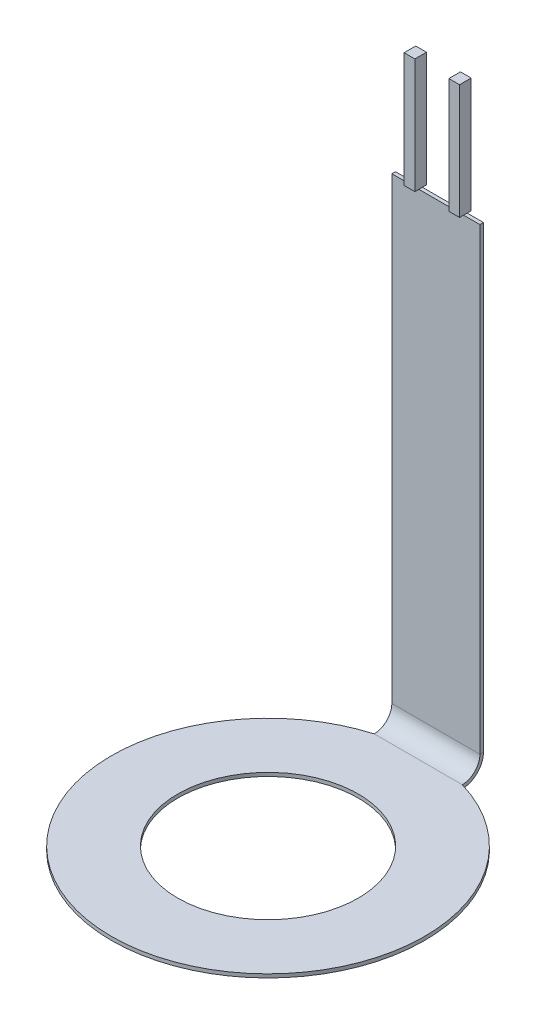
ISO-10303-21;
HEADER;
FILE_DESCRIPTION(('STEP AP214'),'2;1');
FILE_NAME('part.step','',(''),(''),'','','');
FILE_SCHEMA(('AUTOMOTIVE_DESIGN { 1 0 10303 214 1 1 1 1 }'));
ENDSEC;
DATA;
#1=APPLICATION_CONTEXT('core data for automotive mechanical design processes');
#2=APPLICATION_PROTOCOL_DEFINITION('international standard','automotive_design',2000,#1);
#3=PRODUCT_CONTEXT('',#1,'mechanical');
#4=PRODUCT('Part','Part','',(#3));
#5=PRODUCT_RELATED_PRODUCT_CATEGORY('part','',(#4));
#6=PRODUCT_DEFINITION_FORMATION('','',#4);
#7=PRODUCT_DEFINITION_CONTEXT('part definition',#1,'design');
#8=PRODUCT_DEFINITION('design','',#6,#7);
#9=PRODUCT_DEFINITION_SHAPE('','',#8);
#10=(LENGTH_UNIT() NAMED_UNIT(*) SI_UNIT(.MILLI.,.METRE.));
#11=(NAMED_UNIT(*) PLANE_ANGLE_UNIT() SI_UNIT($,.RADIAN.));
#12=(NAMED_UNIT(*) SI_UNIT($,.STERADIAN.) SOLID_ANGLE_UNIT());
#13=UNCERTAINTY_MEASURE_WITH_UNIT(LENGTH_MEASURE(1.E-05),#10,'distance_accuracy_value','');
#14=(GEOMETRIC_REPRESENTATION_CONTEXT(3) GLOBAL_UNCERTAINTY_ASSIGNED_CONTEXT((#13)) GLOBAL_UNIT_ASSIGNED_CONTEXT((#10,
#11,#12)) REPRESENTATION_CONTEXT('',''));
#15=CARTESIAN_POINT('',(0.,0.,0.));
#16=DIRECTION('',(0.,0.,1.));
#17=DIRECTION('',(1.,0.,0.));
#18=AXIS2_PLACEMENT_3D('',#15,#16,#17);
#19=CARTESIAN_POINT('',(2.5,27.0468,-9.73444258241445));
#20=DIRECTION('',(0.,-1.,0.));
#21=DIRECTION('',(0.,0.,-1.));
#22=AXIS2_PLACEMENT_3D('',#19,#20,#21);
#23=PLANE('',#22);
#24=DIRECTION('',(0.,0.,-1.));
#25=VECTOR('',#24,1.);
#26=CARTESIAN_POINT('',(1.5748,27.0468,-9.96304258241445));
#27=LINE('',#26,#25);
#28=CARTESIAN_POINT('',(1.5748,27.0468,-9.53124258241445));
#29=VERTEX_POINT('',#28);
#30=CARTESIAN_POINT('',(1.5748,27.0468,-9.73444258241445));
#31=VERTEX_POINT('',#30);
#32=EDGE_CURVE('E478',#29,#31,#27,.T.);
#33=ORIENTED_EDGE('',*,*,#32,.F.);
#34=DIRECTION('',(-1.,0.,0.));
#35=VECTOR('',#34,1.);
#36=CARTESIAN_POINT('',(2.5,27.0468,-9.53124258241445));
#37=LINE('',#36,#35);
#38=CARTESIAN_POINT('',(2.5,27.0468,-9.53124258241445));
#39=VERTEX_POINT('',#38);
#40=EDGE_CURVE('E352',#29,#39,#37,.F.);
#41=ORIENTED_EDGE('',*,*,#40,.T.);
#42=DIRECTION('',(0.,0.,1.));
#43=VECTOR('',#42,1.);
#44=CARTESIAN_POINT('',(2.5,27.0468,-9.73444258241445));
#45=LINE('',#44,#43);
#46=CARTESIAN_POINT('',(2.5,27.0468,-9.73444258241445));
#47=VERTEX_POINT('',#46);
#48=EDGE_CURVE('E328',#47,#39,#45,.T.);
#49=ORIENTED_EDGE('',*,*,#48,.F.);
#50=DIRECTION('',(1.,0.,0.));
#51=VECTOR('',#50,1.);
#52=CARTESIAN_POINT('',(0.,27.0468,-9.73444258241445));
#53=LINE('',#52,#51);
#54=EDGE_CURVE('E85',#31,#47,#53,.T.);
#55=ORIENTED_EDGE('',*,*,#54,.F.);
#56=EDGE_LOOP('',(#33,#41,#49,#55));
#57=FACE_BOUND('',#56,.T.);
#58=ADVANCED_FACE('F62',(#57),#23,.F.);
#59=DIRECTION('',(0.,0.,1.));
#60=VECTOR('',#59,1.);
#61=CARTESIAN_POINT('',(0.965199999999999,27.0468,-9.96304258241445));
#62=LINE('',#61,#60);
#63=CARTESIAN_POINT('',(0.965199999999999,27.0468,-9.73444258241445));
#64=VERTEX_POINT('',#63);
#65=CARTESIAN_POINT('',(0.965199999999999,27.0468,-9.53124258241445));
#66=VERTEX_POINT('',#65);
#67=EDGE_CURVE('E96',#64,#66,#62,.T.);
#68=ORIENTED_EDGE('',*,*,#67,.F.);
#69=CARTESIAN_POINT('',(-0.965199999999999,27.0468,-9.73444258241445));
#70=VERTEX_POINT('',#69);
#71=EDGE_CURVE('E425',#70,#64,#53,.T.);
#72=ORIENTED_EDGE('',*,*,#71,.F.);
#73=DIRECTION('',(0.,0.,-1.));
#74=VECTOR('',#73,1.);
#75=CARTESIAN_POINT('',(-0.9652,27.0468,-9.96304258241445));
#76=LINE('',#75,#74);
#77=CARTESIAN_POINT('',(-0.965199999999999,27.0468,-9.53124258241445));
#78=VERTEX_POINT('',#77);
#79=EDGE_CURVE('E13',#78,#70,#76,.T.);
#80=ORIENTED_EDGE('',*,*,#79,.F.);
#81=EDGE_CURVE('E461',#78,#66,#37,.F.);
#82=ORIENTED_EDGE('',*,*,#81,.T.);
#83=EDGE_LOOP('',(#68,#72,#80,#82));
#84=FACE_BOUND('',#83,.T.);
#85=ADVANCED_FACE('F505',(#84),#23,.F.);
#86=DIRECTION('',(0.,0.,1.));
#87=VECTOR('',#86,1.);
#88=CARTESIAN_POINT('',(-1.5748,27.0468,-9.96304258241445));
#89=LINE('',#88,#87);
#90=CARTESIAN_POINT('',(-1.5748,27.0468,-9.73444258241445));
#91=VERTEX_POINT('',#90);
#92=CARTESIAN_POINT('',(-1.5748,27.0468,-9.53124258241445));
#93=VERTEX_POINT('',#92);
#94=EDGE_CURVE('E72',#91,#93,#89,.T.);
#95=ORIENTED_EDGE('',*,*,#94,.F.);
#96=CARTESIAN_POINT('',(-2.5,27.0468,-9.73444258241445));
#97=VERTEX_POINT('',#96);
#98=EDGE_CURVE('E336',#97,#91,#53,.T.);
#99=ORIENTED_EDGE('',*,*,#98,.F.);
#100=DIRECTION('',(0.,0.,1.));
#101=VECTOR('',#100,1.);
#102=CARTESIAN_POINT('',(-2.5,27.0468,-9.73444258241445));
#103=LINE('',#102,#101);
#104=CARTESIAN_POINT('',(-2.5,27.0468,-9.53124258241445));
#105=VERTEX_POINT('',#104);
#106=EDGE_CURVE('E323',#97,#105,#103,.T.);
#107=ORIENTED_EDGE('',*,*,#106,.T.);
#108=EDGE_CURVE('E348',#105,#93,#37,.F.);
#109=ORIENTED_EDGE('',*,*,#108,.T.);
#110=EDGE_LOOP('',(#95,#99,#107,#109));
#111=FACE_BOUND('',#110,.T.);
#112=ADVANCED_FACE('F530',(#111),#23,.F.);
#113=CARTESIAN_POINT('',(0.,0.,0.));
#114=DIRECTION('',(0.,1.,0.));
#115=DIRECTION('',(0.,0.,1.));
#116=AXIS2_PLACEMENT_3D('',#113,#114,#115);
#117=PLANE('',#116);
#118=CARTESIAN_POINT('',(0.,0.,0.));
#119=DIRECTION('',(0.,1.,0.));
#120=DIRECTION('',(0.,0.,1.));
#121=AXIS2_PLACEMENT_3D('',#118,#119,#120);
#122=CIRCLE('',#121,5.125);
#123=CARTESIAN_POINT('',(0.,0.,5.125));
#124=VERTEX_POINT('',#123);
#125=EDGE_CURVE('E314',#124,#124,#122,.T.);
#126=ORIENTED_EDGE('',*,*,#125,.F.);
#127=EDGE_LOOP('',(#126));
#128=FACE_BOUND('',#127,.T.);
#129=DIRECTION('',(-1.,0.,0.));
#130=VECTOR('',#129,1.);
#131=CARTESIAN_POINT('',(-2.5,0.,-8.53124258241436));
#132=LINE('',#131,#130);
#133=CARTESIAN_POINT('',(2.5,0.,-8.53124258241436));
#134=VERTEX_POINT('',#133);
#135=CARTESIAN_POINT('',(-2.5,0.,-8.53124258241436));
#136=VERTEX_POINT('',#135);
#137=EDGE_CURVE('E392',#134,#136,#132,.T.);
#138=ORIENTED_EDGE('',*,*,#137,.T.);
#139=CARTESIAN_POINT('',(0.,0.,0.));
#140=DIRECTION('',(0.,1.,0.));
#141=DIRECTION('',(0.,0.,1.));
#142=AXIS2_PLACEMENT_3D('',#139,#140,#141);
#143=CIRCLE('',#142,8.89);
#144=EDGE_CURVE('E388',#136,#134,#143,.T.);
#145=ORIENTED_EDGE('',*,*,#144,.T.);
#146=EDGE_LOOP('',(#138,#145));
#147=FACE_BOUND('',#146,.T.);
#148=ADVANCED_FACE('F64',(#128,#147),#117,.T.);
#149=CARTESIAN_POINT('',(0.,-0.2042,0.));
#150=DIRECTION('',(0.,1.,0.));
#151=DIRECTION('',(0.,0.,1.));
#152=AXIS2_PLACEMENT_3D('',#149,#150,#151);
#153=CYLINDRICAL_SURFACE('',#152,8.89);
#154=DIRECTION('',(0.,1.,0.));
#155=VECTOR('',#154,1.);
#156=CARTESIAN_POINT('',(2.5,-0.2042,-8.53124258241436));
#157=LINE('',#156,#155);
#158=CARTESIAN_POINT('',(2.5,-0.2032,-8.53124258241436));
#159=VERTEX_POINT('',#158);
#160=EDGE_CURVE('E396',#159,#134,#157,.T.);
#161=ORIENTED_EDGE('',*,*,#160,.T.);
#162=ORIENTED_EDGE('',*,*,#144,.F.);
#163=DIRECTION('',(0.,1.,0.));
#164=VECTOR('',#163,1.);
#165=CARTESIAN_POINT('',(-2.5,-0.2042,-8.53124258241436));
#166=LINE('',#165,#164);
#167=CARTESIAN_POINT('',(-2.5,-0.203200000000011,-8.53124258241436));
#168=VERTEX_POINT('',#167);
#169=EDGE_CURVE('E397',#168,#136,#166,.T.);
#170=ORIENTED_EDGE('',*,*,#169,.F.);
#171=CARTESIAN_POINT('',(0.,-0.2032,0.));
#172=DIRECTION('',(0.,1.,0.));
#173=DIRECTION('',(0.,0.,1.));
#174=AXIS2_PLACEMENT_3D('',#171,#172,#173);
#175=CIRCLE('',#174,8.89);
#176=EDGE_CURVE('E373',#159,#168,#175,.F.);
#177=ORIENTED_EDGE('',*,*,#176,.F.);
#178=EDGE_LOOP('',(#161,#162,#170,#177));
#179=FACE_BOUND('',#178,.T.);
#180=ADVANCED_FACE('F405',(#179),#153,.T.);
#181=CARTESIAN_POINT('',(0.,-0.2032,0.));
#182=DIRECTION('',(0.,1.,0.));
#183=DIRECTION('',(0.,0.,1.));
#184=AXIS2_PLACEMENT_3D('',#181,#182,#183);
#185=PLANE('',#184);
#186=CARTESIAN_POINT('',(0.,-0.2032,0.));
#187=DIRECTION('',(0.,1.,0.));
#188=DIRECTION('',(0.,0.,1.));
#189=AXIS2_PLACEMENT_3D('',#186,#187,#188);
#190=CIRCLE('',#189,5.125);
#191=CARTESIAN_POINT('',(0.,-0.2032,5.125));
#192=VERTEX_POINT('',#191);
#193=EDGE_CURVE('E318',#192,#192,#190,.F.);
#194=ORIENTED_EDGE('',*,*,#193,.F.);
#195=EDGE_LOOP('',(#194));
#196=FACE_BOUND('',#195,.T.);
#197=ORIENTED_EDGE('',*,*,#176,.T.);
#198=DIRECTION('',(1.,0.,0.));
#199=VECTOR('',#198,1.);
#200=CARTESIAN_POINT('',(-2.5,-0.2032,-8.53124258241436));
#201=LINE('',#200,#199);
#202=EDGE_CURVE('E66',#168,#159,#201,.T.);
#203=ORIENTED_EDGE('',*,*,#202,.T.);
#204=EDGE_LOOP('',(#197,#203));
#205=FACE_BOUND('',#204,.T.);
#206=ADVANCED_FACE('F544',(#196,#205),#185,.F.);
#207=CARTESIAN_POINT('',(2.5,0.99999999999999,-8.53124258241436));
#208=DIRECTION('',(1.,0.,0.));
#209=DIRECTION('',(0.,0.,-1.));
#210=AXIS2_PLACEMENT_3D('',#207,#208,#209);
#211=PLANE('',#210);
#212=DIRECTION('',(0.,0.,1.));
#213=VECTOR('',#212,1.);
#214=CARTESIAN_POINT('',(2.5,0.999999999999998,-9.73444258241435));
#215=LINE('',#214,#213);
#216=CARTESIAN_POINT('',(2.5,0.999999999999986,-9.53124258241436));
#217=VERTEX_POINT('',#216);
#218=CARTESIAN_POINT('',(2.5,0.999999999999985,-9.73444258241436));
#219=VERTEX_POINT('',#218);
#220=EDGE_CURVE('E322',#217,#219,#215,.F.);
#221=ORIENTED_EDGE('',*,*,#220,.F.);
#222=CARTESIAN_POINT('',(2.5,0.99999999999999,-8.53124258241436));
#223=DIRECTION('',(-1.,0.,0.));
#224=DIRECTION('',(0.,0.,1.));
#225=AXIS2_PLACEMENT_3D('',#222,#223,#224);
#226=CIRCLE('',#225,1.);
#227=EDGE_CURVE('E378',#134,#217,#226,.F.);
#228=ORIENTED_EDGE('',*,*,#227,.F.);
#229=ORIENTED_EDGE('',*,*,#160,.F.);
#230=CARTESIAN_POINT('',(2.5,0.99999999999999,-8.53124258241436));
#231=DIRECTION('',(-1.,0.,0.));
#232=DIRECTION('',(0.,0.,1.));
#233=AXIS2_PLACEMENT_3D('',#230,#231,#232);
#234=CIRCLE('',#233,1.2032);
#235=EDGE_CURVE('E369',#159,#219,#234,.F.);
#236=ORIENTED_EDGE('',*,*,#235,.T.);
#237=EDGE_LOOP('',(#221,#228,#229,#236));
#238=FACE_BOUND('',#237,.T.);
#239=ADVANCED_FACE('F415',(#238),#211,.T.);
#240=CARTESIAN_POINT('',(-2.5,0.99999999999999,-8.53124258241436));
#241=DIRECTION('',(1.,0.,0.));
#242=DIRECTION('',(0.,0.,-1.));
#243=AXIS2_PLACEMENT_3D('',#240,#241,#242);
#244=PLANE('',#243);
#245=CARTESIAN_POINT('',(-2.5,0.99999999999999,-8.53124258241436));
#246=DIRECTION('',(-1.,0.,0.));
#247=DIRECTION('',(0.,0.,1.));
#248=AXIS2_PLACEMENT_3D('',#245,#246,#247);
#249=CIRCLE('',#248,1.);
#250=CARTESIAN_POINT('',(-2.5,0.999999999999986,-9.53124258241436));
#251=VERTEX_POINT('',#250);
#252=EDGE_CURVE('E327',#251,#136,#249,.T.);
#253=ORIENTED_EDGE('',*,*,#252,.F.);
#254=DIRECTION('',(0.,0.,1.));
#255=VECTOR('',#254,1.);
#256=CARTESIAN_POINT('',(-2.5,0.999999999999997,-9.53124258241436));
#257=LINE('',#256,#255);
#258=CARTESIAN_POINT('',(-2.5,0.999999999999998,-9.73444258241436));
#259=VERTEX_POINT('',#258);
#260=EDGE_CURVE('E359',#251,#259,#257,.F.);
#261=ORIENTED_EDGE('',*,*,#260,.T.);
#262=CARTESIAN_POINT('',(-2.5,0.99999999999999,-8.53124258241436));
#263=DIRECTION('',(-1.,0.,0.));
#264=DIRECTION('',(0.,0.,1.));
#265=AXIS2_PLACEMENT_3D('',#262,#263,#264);
#266=CIRCLE('',#265,1.2032);
#267=EDGE_CURVE('E374',#259,#168,#266,.T.);
#268=ORIENTED_EDGE('',*,*,#267,.T.);
#269=ORIENTED_EDGE('',*,*,#169,.T.);
#270=EDGE_LOOP('',(#253,#261,#268,#269));
#271=FACE_BOUND('',#270,.T.);
#272=ADVANCED_FACE('F432',(#271),#244,.F.);
#273=CARTESIAN_POINT('',(-2.5,0.99999999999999,-8.53124258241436));
#274=DIRECTION('',(-1.,0.,0.));
#275=DIRECTION('',(0.,0.,-1.));
#276=AXIS2_PLACEMENT_3D('',#273,#274,#275);
#277=CYLINDRICAL_SURFACE('',#276,1.2032);
#278=ORIENTED_EDGE('',*,*,#202,.F.);
#279=ORIENTED_EDGE('',*,*,#267,.F.);
#280=DIRECTION('',(-1.,0.,0.));
#281=VECTOR('',#280,1.);
#282=CARTESIAN_POINT('',(2.5,0.999999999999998,-9.73444258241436));
#283=LINE('',#282,#281);
#284=EDGE_CURVE('E356',#259,#219,#283,.F.);
#285=ORIENTED_EDGE('',*,*,#284,.T.);
#286=ORIENTED_EDGE('',*,*,#235,.F.);
#287=EDGE_LOOP('',(#278,#279,#285,#286));
#288=FACE_BOUND('',#287,.T.);
#289=ADVANCED_FACE('F558',(#288),#277,.T.);
#290=CARTESIAN_POINT('',(-2.5,0.99999999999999,-8.53124258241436));
#291=DIRECTION('',(-1.,0.,0.));
#292=DIRECTION('',(0.,0.,-1.));
#293=AXIS2_PLACEMENT_3D('',#290,#291,#292);
#294=CYLINDRICAL_SURFACE('',#293,1.);
#295=ORIENTED_EDGE('',*,*,#137,.F.);
#296=ORIENTED_EDGE('',*,*,#227,.T.);
#297=DIRECTION('',(-1.,0.,0.));
#298=VECTOR('',#297,1.);
#299=CARTESIAN_POINT('',(2.5,0.999999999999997,-9.53124258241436));
#300=LINE('',#299,#298);
#301=EDGE_CURVE('E363',#217,#251,#300,.T.);
#302=ORIENTED_EDGE('',*,*,#301,.T.);
#303=ORIENTED_EDGE('',*,*,#252,.T.);
#304=EDGE_LOOP('',(#295,#296,#302,#303));
#305=FACE_BOUND('',#304,.T.);
#306=ADVANCED_FACE('F412',(#305),#294,.F.);
#307=CARTESIAN_POINT('',(-2.5,27.0468,-9.73444258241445));
#308=DIRECTION('',(1.,0.,0.));
#309=DIRECTION('',(0.,0.,-1.));
#310=AXIS2_PLACEMENT_3D('',#307,#308,#309);
#311=PLANE('',#310);
#312=ORIENTED_EDGE('',*,*,#260,.F.);
#313=DIRECTION('',(0.,-1.,0.));
#314=VECTOR('',#313,1.);
#315=CARTESIAN_POINT('',(-2.5,27.0468,-9.53124258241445));
#316=LINE('',#315,#314);
#317=EDGE_CURVE('E353',#251,#105,#316,.F.);
#318=ORIENTED_EDGE('',*,*,#317,.T.);
#319=ORIENTED_EDGE('',*,*,#106,.F.);
#320=DIRECTION('',(0.,1.,0.));
#321=VECTOR('',#320,1.);
#322=CARTESIAN_POINT('',(-2.5,0.,-9.73444258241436));
#323=LINE('',#322,#321);
#324=EDGE_CURVE('E341',#259,#97,#323,.T.);
#325=ORIENTED_EDGE('',*,*,#324,.F.);
#326=EDGE_LOOP('',(#312,#318,#319,#325));
#327=FACE_BOUND('',#326,.T.);
#328=ADVANCED_FACE('F434',(#327),#311,.F.);
#329=CARTESIAN_POINT('',(2.5,0.,-9.73444258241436));
#330=DIRECTION('',(-1.,0.,0.));
#331=DIRECTION('',(0.,0.,1.));
#332=AXIS2_PLACEMENT_3D('',#329,#330,#331);
#333=PLANE('',#332);
#334=ORIENTED_EDGE('',*,*,#220,.T.);
#335=DIRECTION('',(0.,-1.,0.));
#336=VECTOR('',#335,1.);
#337=CARTESIAN_POINT('',(2.5,0.,-9.73444258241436));
#338=LINE('',#337,#336);
#339=EDGE_CURVE('E332',#47,#219,#338,.T.);
#340=ORIENTED_EDGE('',*,*,#339,.F.);
#341=ORIENTED_EDGE('',*,*,#48,.T.);
#342=DIRECTION('',(0.,1.,0.));
#343=VECTOR('',#342,1.);
#344=CARTESIAN_POINT('',(2.5,0.,-9.53124258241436));
#345=LINE('',#344,#343);
#346=EDGE_CURVE('E344',#39,#217,#345,.F.);
#347=ORIENTED_EDGE('',*,*,#346,.T.);
#348=EDGE_LOOP('',(#334,#340,#341,#347));
#349=FACE_BOUND('',#348,.T.);
#350=ADVANCED_FACE('F418',(#349),#333,.F.);
#351=CARTESIAN_POINT('',(0.,0.,-9.73444258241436));
#352=DIRECTION('',(0.,0.,1.));
#353=DIRECTION('',(0.,-1.,0.));
#354=AXIS2_PLACEMENT_3D('',#351,#352,#353);
#355=PLANE('',#354);
#356=ORIENTED_EDGE('',*,*,#284,.F.);
#357=ORIENTED_EDGE('',*,*,#324,.T.);
#358=ORIENTED_EDGE('',*,*,#98,.T.);
#359=EDGE_CURVE('E340',#91,#70,#53,.T.);
#360=ORIENTED_EDGE('',*,*,#359,.T.);
#361=ORIENTED_EDGE('',*,*,#71,.T.);
#362=DIRECTION('',(-1.,0.,0.));
#363=VECTOR('',#362,1.);
#364=CARTESIAN_POINT('',(0.,27.0468,-9.73444258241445));
#365=LINE('',#364,#363);
#366=EDGE_CURVE('E260',#31,#64,#365,.T.);
#367=ORIENTED_EDGE('',*,*,#366,.F.);
#368=ORIENTED_EDGE('',*,*,#54,.T.);
#369=ORIENTED_EDGE('',*,*,#339,.T.);
#370=EDGE_LOOP('',(#356,#357,#358,#360,#361,#367,#368,#369));
#371=FACE_BOUND('',#370,.T.);
#372=ADVANCED_FACE('F422',(#371),#355,.F.);
#373=CARTESIAN_POINT('',(0.,0.,-9.53124258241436));
#374=DIRECTION('',(0.,0.,1.));
#375=DIRECTION('',(0.,-1.,0.));
#376=AXIS2_PLACEMENT_3D('',#373,#374,#375);
#377=PLANE('',#376);
#378=ORIENTED_EDGE('',*,*,#317,.F.);
#379=ORIENTED_EDGE('',*,*,#301,.F.);
#380=ORIENTED_EDGE('',*,*,#346,.F.);
#381=ORIENTED_EDGE('',*,*,#40,.F.);
#382=EDGE_CURVE('E499',#66,#29,#37,.F.);
#383=ORIENTED_EDGE('',*,*,#382,.F.);
#384=ORIENTED_EDGE('',*,*,#81,.F.);
#385=EDGE_CURVE('E351',#93,#78,#37,.F.);
#386=ORIENTED_EDGE('',*,*,#385,.F.);
#387=ORIENTED_EDGE('',*,*,#108,.F.);
#388=EDGE_LOOP('',(#378,#379,#380,#381,#383,#384,#386,#387));
#389=FACE_BOUND('',#388,.T.);
#390=ADVANCED_FACE('F428',(#389),#377,.T.);
#391=CARTESIAN_POINT('',(0.,-0.204200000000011,0.));
#392=DIRECTION('',(0.,1.,0.));
#393=DIRECTION('',(0.,0.,1.));
#394=AXIS2_PLACEMENT_3D('',#391,#392,#393);
#395=CYLINDRICAL_SURFACE('',#394,5.125);
#396=ORIENTED_EDGE('',*,*,#125,.T.);
#397=EDGE_LOOP('',(#396));
#398=FACE_BOUND('',#397,.T.);
#399=ORIENTED_EDGE('',*,*,#193,.T.);
#400=EDGE_LOOP('',(#399));
#401=FACE_BOUND('',#400,.T.);
#402=ADVANCED_FACE('F548',(#398,#401),#395,.F.);
#403=CARTESIAN_POINT('',(0.,27.0468000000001,-1.42091819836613E-13));
#404=DIRECTION('',(0.,1.,0.));
#405=DIRECTION('',(0.,0.,1.));
#406=AXIS2_PLACEMENT_3D('',#403,#404,#405);
#407=PLANE('',#406);
#408=CARTESIAN_POINT('',(-1.5748,27.0468,-9.30264258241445));
#409=VERTEX_POINT('',#408);
#410=EDGE_CURVE('E292',#93,#409,#89,.T.);
#411=ORIENTED_EDGE('',*,*,#410,.F.);
#412=ORIENTED_EDGE('',*,*,#385,.T.);
#413=CARTESIAN_POINT('',(-0.965199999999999,27.0468,-9.30264258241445));
#414=VERTEX_POINT('',#413);
#415=EDGE_CURVE('E74',#414,#78,#76,.T.);
#416=ORIENTED_EDGE('',*,*,#415,.F.);
#417=DIRECTION('',(1.,0.,0.));
#418=VECTOR('',#417,1.);
#419=CARTESIAN_POINT('',(-1.5748,27.0468,-9.30264258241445));
#420=LINE('',#419,#418);
#421=EDGE_CURVE('E277',#409,#414,#420,.T.);
#422=ORIENTED_EDGE('',*,*,#421,.F.);
#423=EDGE_LOOP('',(#411,#412,#416,#422));
#424=FACE_BOUND('',#423,.T.);
#425=ADVANCED_FACE('F510',(#424),#407,.F.);
#426=CARTESIAN_POINT('',(-0.9652,33.5746,-9.96304258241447));
#427=DIRECTION('',(-1.,0.,0.));
#428=DIRECTION('',(0.,0.,1.));
#429=AXIS2_PLACEMENT_3D('',#426,#427,#428);
#430=PLANE('',#429);
#431=ORIENTED_EDGE('',*,*,#415,.T.);
#432=ORIENTED_EDGE('',*,*,#79,.T.);
#433=CARTESIAN_POINT('',(-0.9652,27.0468,-9.96304258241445));
#434=VERTEX_POINT('',#433);
#435=EDGE_CURVE('E75',#70,#434,#76,.T.);
#436=ORIENTED_EDGE('',*,*,#435,.T.);
#437=DIRECTION('',(0.,-1.,0.));
#438=VECTOR('',#437,1.);
#439=CARTESIAN_POINT('',(-0.9652,33.5746,-9.96304258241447));
#440=LINE('',#439,#438);
#441=CARTESIAN_POINT('',(-0.9652,33.5746,-9.96304258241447));
#442=VERTEX_POINT('',#441);
#443=EDGE_CURVE('E310',#442,#434,#440,.T.);
#444=ORIENTED_EDGE('',*,*,#443,.F.);
#445=DIRECTION('',(0.,0.,-1.));
#446=VECTOR('',#445,1.);
#447=CARTESIAN_POINT('',(-0.9652,33.5746,-9.96304258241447));
#448=LINE('',#447,#446);
#449=CARTESIAN_POINT('',(-0.965199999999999,33.5746,-9.30264258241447));
#450=VERTEX_POINT('',#449);
#451=EDGE_CURVE('E272',#450,#442,#448,.T.);
#452=ORIENTED_EDGE('',*,*,#451,.F.);
#453=DIRECTION('',(0.,-1.,0.));
#454=VECTOR('',#453,1.);
#455=CARTESIAN_POINT('',(-0.965199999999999,33.5746,-9.30264258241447));
#456=LINE('',#455,#454);
#457=EDGE_CURVE('E285',#450,#414,#456,.T.);
#458=ORIENTED_EDGE('',*,*,#457,.T.);
#459=EDGE_LOOP('',(#431,#432,#436,#444,#452,#458));
#460=FACE_BOUND('',#459,.T.);
#461=ADVANCED_FACE('F457',(#460),#430,.F.);
#462=CARTESIAN_POINT('',(-1.5748,33.5746,-9.96304258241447));
#463=DIRECTION('',(0.,0.,1.));
#464=DIRECTION('',(0.,-1.,0.));
#465=AXIS2_PLACEMENT_3D('',#462,#463,#464);
#466=PLANE('',#465);
#467=DIRECTION('',(-1.,0.,0.));
#468=VECTOR('',#467,1.);
#469=CARTESIAN_POINT('',(-1.5748,27.0468,-9.96304258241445));
#470=LINE('',#469,#468);
#471=CARTESIAN_POINT('',(-1.5748,27.0468,-9.96304258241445));
#472=VERTEX_POINT('',#471);
#473=EDGE_CURVE('E289',#434,#472,#470,.T.);
#474=ORIENTED_EDGE('',*,*,#473,.T.);
#475=DIRECTION('',(0.,-1.,0.));
#476=VECTOR('',#475,1.);
#477=CARTESIAN_POINT('',(-1.5748,33.5746,-9.96304258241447));
#478=LINE('',#477,#476);
#479=CARTESIAN_POINT('',(-1.5748,33.5746,-9.96304258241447));
#480=VERTEX_POINT('',#479);
#481=EDGE_CURVE('E306',#480,#472,#478,.T.);
#482=ORIENTED_EDGE('',*,*,#481,.F.);
#483=DIRECTION('',(-1.,0.,0.));
#484=VECTOR('',#483,1.);
#485=CARTESIAN_POINT('',(-1.5748,33.5746,-9.96304258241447));
#486=LINE('',#485,#484);
#487=EDGE_CURVE('E276',#442,#480,#486,.T.);
#488=ORIENTED_EDGE('',*,*,#487,.F.);
#489=ORIENTED_EDGE('',*,*,#443,.T.);
#490=EDGE_LOOP('',(#474,#482,#488,#489));
#491=FACE_BOUND('',#490,.T.);
#492=ADVANCED_FACE('F453',(#491),#466,.F.);
#493=CARTESIAN_POINT('',(-1.5748,33.5746,-9.96304258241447));
#494=DIRECTION('',(1.,0.,0.));
#495=DIRECTION('',(0.,0.,-1.));
#496=AXIS2_PLACEMENT_3D('',#493,#494,#495);
#497=PLANE('',#496);
#498=EDGE_CURVE('E293',#472,#91,#89,.T.);
#499=ORIENTED_EDGE('',*,*,#498,.T.);
#500=ORIENTED_EDGE('',*,*,#94,.T.);
#501=ORIENTED_EDGE('',*,*,#410,.T.);
#502=DIRECTION('',(0.,-1.,0.));
#503=VECTOR('',#502,1.);
#504=CARTESIAN_POINT('',(-1.5748,33.5746,-9.30264258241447));
#505=LINE('',#504,#503);
#506=CARTESIAN_POINT('',(-1.5748,33.5746,-9.30264258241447));
#507=VERTEX_POINT('',#506);
#508=EDGE_CURVE('E302',#507,#409,#505,.T.);
#509=ORIENTED_EDGE('',*,*,#508,.F.);
#510=DIRECTION('',(0.,0.,1.));
#511=VECTOR('',#510,1.);
#512=CARTESIAN_POINT('',(-1.5748,33.5746,-9.96304258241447));
#513=LINE('',#512,#511);
#514=EDGE_CURVE('E280',#480,#507,#513,.T.);
#515=ORIENTED_EDGE('',*,*,#514,.F.);
#516=ORIENTED_EDGE('',*,*,#481,.T.);
#517=EDGE_LOOP('',(#499,#500,#501,#509,#515,#516));
#518=FACE_BOUND('',#517,.T.);
#519=ADVANCED_FACE('F448',(#518),#497,.F.);
#520=CARTESIAN_POINT('',(-1.5748,33.5746,-9.30264258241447));
#521=DIRECTION('',(0.,0.,-1.));
#522=DIRECTION('',(0.,1.,0.));
#523=AXIS2_PLACEMENT_3D('',#520,#521,#522);
#524=PLANE('',#523);
#525=ORIENTED_EDGE('',*,*,#421,.T.);
#526=ORIENTED_EDGE('',*,*,#457,.F.);
#527=DIRECTION('',(1.,0.,0.));
#528=VECTOR('',#527,1.);
#529=CARTESIAN_POINT('',(-1.5748,33.5746,-9.30264258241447));
#530=LINE('',#529,#528);
#531=EDGE_CURVE('E283',#507,#450,#530,.T.);
#532=ORIENTED_EDGE('',*,*,#531,.F.);
#533=ORIENTED_EDGE('',*,*,#508,.T.);
#534=EDGE_LOOP('',(#525,#526,#532,#533));
#535=FACE_BOUND('',#534,.T.);
#536=ADVANCED_FACE('F515',(#535),#524,.F.);
#537=CARTESIAN_POINT('',(0.,33.5746000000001,-1.64883511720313E-13));
#538=DIRECTION('',(0.,1.,0.));
#539=DIRECTION('',(0.,0.,1.));
#540=AXIS2_PLACEMENT_3D('',#537,#538,#539);
#541=PLANE('',#540);
#542=ORIENTED_EDGE('',*,*,#451,.T.);
#543=ORIENTED_EDGE('',*,*,#487,.T.);
#544=ORIENTED_EDGE('',*,*,#514,.T.);
#545=ORIENTED_EDGE('',*,*,#531,.T.);
#546=EDGE_LOOP('',(#542,#543,#544,#545));
#547=FACE_BOUND('',#546,.T.);
#548=ADVANCED_FACE('F517',(#547),#541,.T.);
#549=ORIENTED_EDGE('',*,*,#359,.F.);
#550=ORIENTED_EDGE('',*,*,#498,.F.);
#551=ORIENTED_EDGE('',*,*,#473,.F.);
#552=ORIENTED_EDGE('',*,*,#435,.F.);
#553=EDGE_LOOP('',(#549,#550,#551,#552));
#554=FACE_BOUND('',#553,.T.);
#555=ADVANCED_FACE('F443',(#554),#407,.F.);
#556=CARTESIAN_POINT('',(0.,27.0468000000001,-1.42091819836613E-13));
#557=DIRECTION('',(0.,1.,0.));
#558=DIRECTION('',(0.,0.,1.));
#559=AXIS2_PLACEMENT_3D('',#556,#557,#558);
#560=PLANE('',#559);
#561=CARTESIAN_POINT('',(1.5748,27.0468,-9.96304258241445));
#562=VERTEX_POINT('',#561);
#563=EDGE_CURVE('E257',#31,#562,#27,.T.);
#564=ORIENTED_EDGE('',*,*,#563,.F.);
#565=ORIENTED_EDGE('',*,*,#366,.T.);
#566=CARTESIAN_POINT('',(0.965199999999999,27.0468,-9.96304258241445));
#567=VERTEX_POINT('',#566);
#568=EDGE_CURVE('E482',#567,#64,#62,.T.);
#569=ORIENTED_EDGE('',*,*,#568,.F.);
#570=DIRECTION('',(-1.,0.,0.));
#571=VECTOR('',#570,1.);
#572=CARTESIAN_POINT('',(0.965199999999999,27.0468,-9.96304258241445));
#573=LINE('',#572,#571);
#574=EDGE_CURVE('E477',#562,#567,#573,.T.);
#575=ORIENTED_EDGE('',*,*,#574,.F.);
#576=EDGE_LOOP('',(#564,#565,#569,#575));
#577=FACE_BOUND('',#576,.T.);
#578=ADVANCED_FACE('F524',(#577),#560,.F.);
#579=CARTESIAN_POINT('',(1.5748,33.5746,-9.96304258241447));
#580=DIRECTION('',(-1.,0.,0.));
#581=DIRECTION('',(0.,0.,1.));
#582=AXIS2_PLACEMENT_3D('',#579,#580,#581);
#583=PLANE('',#582);
#584=CARTESIAN_POINT('',(1.5748,27.0468,-9.30264258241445));
#585=VERTEX_POINT('',#584);
#586=EDGE_CURVE('E474',#585,#29,#27,.T.);
#587=ORIENTED_EDGE('',*,*,#586,.T.);
#588=ORIENTED_EDGE('',*,*,#32,.T.);
#589=ORIENTED_EDGE('',*,*,#563,.T.);
#590=DIRECTION('',(0.,-1.,0.));
#591=VECTOR('',#590,1.);
#592=CARTESIAN_POINT('',(1.5748,33.5746,-9.96304258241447));
#593=LINE('',#592,#591);
#594=CARTESIAN_POINT('',(1.5748,33.5746,-9.96304258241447));
#595=VERTEX_POINT('',#594);
#596=EDGE_CURVE('E234',#595,#562,#593,.T.);
#597=ORIENTED_EDGE('',*,*,#596,.F.);
#598=DIRECTION('',(0.,0.,-1.));
#599=VECTOR('',#598,1.);
#600=CARTESIAN_POINT('',(1.5748,33.5746,-9.96304258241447));
#601=LINE('',#600,#599);
#602=CARTESIAN_POINT('',(1.5748,33.5746,-9.30264258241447));
#603=VERTEX_POINT('',#602);
#604=EDGE_CURVE('E241',#603,#595,#601,.T.);
#605=ORIENTED_EDGE('',*,*,#604,.F.);
#606=DIRECTION('',(0.,-1.,0.));
#607=VECTOR('',#606,1.);
#608=CARTESIAN_POINT('',(1.5748,33.5746,-9.30264258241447));
#609=LINE('',#608,#607);
#610=EDGE_CURVE('E469',#603,#585,#609,.T.);
#611=ORIENTED_EDGE('',*,*,#610,.T.);
#612=EDGE_LOOP('',(#587,#588,#589,#597,#605,#611));
#613=FACE_BOUND('',#612,.T.);
#614=ADVANCED_FACE('F254',(#613),#583,.F.);
#615=CARTESIAN_POINT('',(0.965199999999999,33.5746,-9.96304258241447));
#616=DIRECTION('',(0.,0.,1.));
#617=DIRECTION('',(0.,-1.,0.));
#618=AXIS2_PLACEMENT_3D('',#615,#616,#617);
#619=PLANE('',#618);
#620=ORIENTED_EDGE('',*,*,#574,.T.);
#621=DIRECTION('',(0.,-1.,0.));
#622=VECTOR('',#621,1.);
#623=CARTESIAN_POINT('',(0.965199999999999,33.5746,-9.96304258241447));
#624=LINE('',#623,#622);
#625=CARTESIAN_POINT('',(0.965199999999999,33.5746,-9.96304258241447));
#626=VERTEX_POINT('',#625);
#627=EDGE_CURVE('E236',#626,#567,#624,.T.);
#628=ORIENTED_EDGE('',*,*,#627,.F.);
#629=DIRECTION('',(-1.,0.,0.));
#630=VECTOR('',#629,1.);
#631=CARTESIAN_POINT('',(0.965199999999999,33.5746,-9.96304258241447));
#632=LINE('',#631,#630);
#633=EDGE_CURVE('E230',#595,#626,#632,.T.);
#634=ORIENTED_EDGE('',*,*,#633,.F.);
#635=ORIENTED_EDGE('',*,*,#596,.T.);
#636=EDGE_LOOP('',(#620,#628,#634,#635));
#637=FACE_BOUND('',#636,.T.);
#638=ADVANCED_FACE('F232',(#637),#619,.F.);
#639=CARTESIAN_POINT('',(0.965199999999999,33.5746,-9.96304258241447));
#640=DIRECTION('',(1.,0.,0.));
#641=DIRECTION('',(0.,0.,-1.));
#642=AXIS2_PLACEMENT_3D('',#639,#640,#641);
#643=PLANE('',#642);
#644=ORIENTED_EDGE('',*,*,#568,.T.);
#645=ORIENTED_EDGE('',*,*,#67,.T.);
#646=CARTESIAN_POINT('',(0.965199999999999,27.0468,-9.30264258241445));
#647=VERTEX_POINT('',#646);
#648=EDGE_CURVE('E481',#66,#647,#62,.T.);
#649=ORIENTED_EDGE('',*,*,#648,.T.);
#650=DIRECTION('',(0.,-1.,0.));
#651=VECTOR('',#650,1.);
#652=CARTESIAN_POINT('',(0.965199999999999,33.5746,-9.30264258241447));
#653=LINE('',#652,#651);
#654=CARTESIAN_POINT('',(0.965199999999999,33.5746,-9.30264258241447));
#655=VERTEX_POINT('',#654);
#656=EDGE_CURVE('E268',#655,#647,#653,.T.);
#657=ORIENTED_EDGE('',*,*,#656,.F.);
#658=DIRECTION('',(0.,0.,1.));
#659=VECTOR('',#658,1.);
#660=CARTESIAN_POINT('',(0.965199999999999,33.5746,-9.96304258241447));
#661=LINE('',#660,#659);
#662=EDGE_CURVE('E240',#626,#655,#661,.T.);
#663=ORIENTED_EDGE('',*,*,#662,.F.);
#664=ORIENTED_EDGE('',*,*,#627,.T.);
#665=EDGE_LOOP('',(#644,#645,#649,#657,#663,#664));
#666=FACE_BOUND('',#665,.T.);
#667=ADVANCED_FACE('F732',(#666),#643,.F.);
#668=CARTESIAN_POINT('',(0.965199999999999,33.5746,-9.30264258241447));
#669=DIRECTION('',(0.,0.,-1.));
#670=DIRECTION('',(0.,1.,0.));
#671=AXIS2_PLACEMENT_3D('',#668,#669,#670);
#672=PLANE('',#671);
#673=DIRECTION('',(1.,0.,0.));
#674=VECTOR('',#673,1.);
#675=CARTESIAN_POINT('',(0.965199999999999,27.0468,-9.30264258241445));
#676=LINE('',#675,#674);
#677=EDGE_CURVE('E251',#647,#585,#676,.T.);
#678=ORIENTED_EDGE('',*,*,#677,.T.);
#679=ORIENTED_EDGE('',*,*,#610,.F.);
#680=DIRECTION('',(1.,0.,0.));
#681=VECTOR('',#680,1.);
#682=CARTESIAN_POINT('',(0.965199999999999,33.5746,-9.30264258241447));
#683=LINE('',#682,#681);
#684=EDGE_CURVE('E246',#655,#603,#683,.T.);
#685=ORIENTED_EDGE('',*,*,#684,.F.);
#686=ORIENTED_EDGE('',*,*,#656,.T.);
#687=EDGE_LOOP('',(#678,#679,#685,#686));
#688=FACE_BOUND('',#687,.T.);
#689=ADVANCED_FACE('F492',(#688),#672,.F.);
#690=CARTESIAN_POINT('',(0.,33.5746000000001,-1.64883511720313E-13));
#691=DIRECTION('',(0.,1.,0.));
#692=DIRECTION('',(0.,0.,1.));
#693=AXIS2_PLACEMENT_3D('',#690,#691,#692);
#694=PLANE('',#693);
#695=ORIENTED_EDGE('',*,*,#604,.T.);
#696=ORIENTED_EDGE('',*,*,#633,.T.);
#697=ORIENTED_EDGE('',*,*,#662,.T.);
#698=ORIENTED_EDGE('',*,*,#684,.T.);
#699=EDGE_LOOP('',(#695,#696,#697,#698));
#700=FACE_BOUND('',#699,.T.);
#701=ADVANCED_FACE('F244',(#700),#694,.T.);
#702=ORIENTED_EDGE('',*,*,#382,.T.);
#703=ORIENTED_EDGE('',*,*,#586,.F.);
#704=ORIENTED_EDGE('',*,*,#677,.F.);
#705=ORIENTED_EDGE('',*,*,#648,.F.);
#706=EDGE_LOOP('',(#702,#703,#704,#705));
#707=FACE_BOUND('',#706,.T.);
#708=ADVANCED_FACE('F498',(#707),#560,.F.);
#709=CLOSED_SHELL('',(#58,#85,#112,#148,#180,#206,#239,#272,#289,#306,#328,#350,#372,#390,#402,
#425,#461,#492,#519,#536,#548,#555,#578,#614,#638,#667,#689,#701,#708));
#710=MANIFOLD_SOLID_BREP('B2',#709);
#711=ADVANCED_BREP_SHAPE_REPRESENTATION('',(#18,#710),#14);
#712=SHAPE_DEFINITION_REPRESENTATION(#9,#711);
ENDSEC;
END-ISO-10303-21;
